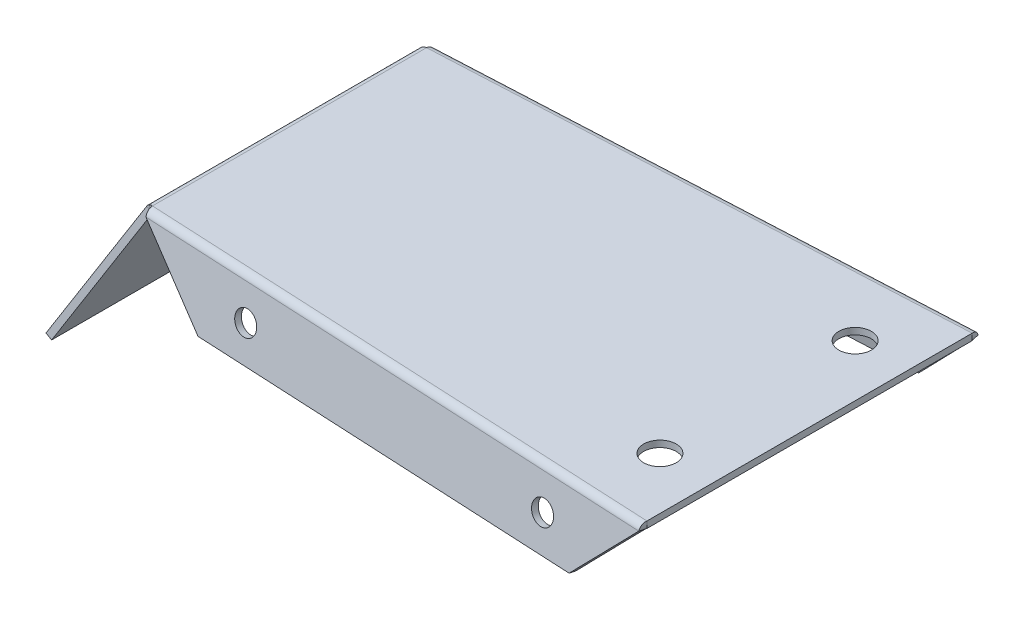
ISO-10303-21;
HEADER;
FILE_DESCRIPTION(('STEP AP214'),'2;1');
FILE_NAME('part.step','',(''),(''),'','','');
FILE_SCHEMA(('AUTOMOTIVE_DESIGN { 1 0 10303 214 1 1 1 1 }'));
ENDSEC;
DATA;
#1=APPLICATION_CONTEXT('core data for automotive mechanical design processes');
#2=APPLICATION_PROTOCOL_DEFINITION('international standard','automotive_design',2000,#1);
#3=PRODUCT_CONTEXT('',#1,'mechanical');
#4=PRODUCT('Part','Part','',(#3));
#5=PRODUCT_RELATED_PRODUCT_CATEGORY('part','',(#4));
#6=PRODUCT_DEFINITION_FORMATION('','',#4);
#7=PRODUCT_DEFINITION_CONTEXT('part definition',#1,'design');
#8=PRODUCT_DEFINITION('design','',#6,#7);
#9=PRODUCT_DEFINITION_SHAPE('','',#8);
#10=(LENGTH_UNIT() NAMED_UNIT(*) SI_UNIT(.MILLI.,.METRE.));
#11=(NAMED_UNIT(*) PLANE_ANGLE_UNIT() SI_UNIT($,.RADIAN.));
#12=(NAMED_UNIT(*) SI_UNIT($,.STERADIAN.) SOLID_ANGLE_UNIT());
#13=UNCERTAINTY_MEASURE_WITH_UNIT(LENGTH_MEASURE(1.E-05),#10,'distance_accuracy_value','');
#14=(GEOMETRIC_REPRESENTATION_CONTEXT(3) GLOBAL_UNCERTAINTY_ASSIGNED_CONTEXT((#13)) GLOBAL_UNIT_ASSIGNED_CONTEXT((#10,
#11,#12)) REPRESENTATION_CONTEXT('',''));
#15=CARTESIAN_POINT('',(0.,0.,0.));
#16=DIRECTION('',(0.,0.,1.));
#17=DIRECTION('',(1.,0.,0.));
#18=AXIS2_PLACEMENT_3D('',#15,#16,#17);
#19=CARTESIAN_POINT('',(105.,0.,-11.4));
#20=DIRECTION('',(0.,-1.,0.));
#21=DIRECTION('',(0.,0.,-1.));
#22=AXIS2_PLACEMENT_3D('',#19,#20,#21);
#23=PLANE('',#22);
#24=CARTESIAN_POINT('',(97.,0.,15.));
#25=DIRECTION('',(0.,1.,0.));
#26=DIRECTION('',(0.,0.,-1.));
#27=AXIS2_PLACEMENT_3D('',#24,#25,#26);
#28=CIRCLE('',#27,2.5);
#29=CARTESIAN_POINT('',(97.,0.,12.5));
#30=VERTEX_POINT('',#29);
#31=EDGE_CURVE('E714',#30,#30,#28,.T.);
#32=ORIENTED_EDGE('',*,*,#31,.F.);
#33=EDGE_LOOP('',(#32));
#34=FACE_BOUND('',#33,.T.);
#35=CARTESIAN_POINT('',(97.,0.,-15.));
#36=DIRECTION('',(0.,1.,0.));
#37=DIRECTION('',(0.,0.,1.));
#38=AXIS2_PLACEMENT_3D('',#35,#36,#37);
#39=CIRCLE('',#38,2.5);
#40=CARTESIAN_POINT('',(97.,0.,-12.5));
#41=VERTEX_POINT('',#40);
#42=EDGE_CURVE('E717',#41,#41,#39,.T.);
#43=ORIENTED_EDGE('',*,*,#42,.F.);
#44=EDGE_LOOP('',(#43));
#45=FACE_BOUND('',#44,.T.);
#46=DIRECTION('',(0.,0.,1.));
#47=VECTOR('',#46,1.);
#48=CARTESIAN_POINT('',(25.057735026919,0.,-11.4));
#49=LINE('',#48,#47);
#50=CARTESIAN_POINT('',(25.0577350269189,0.,-21.0606939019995));
#51=VERTEX_POINT('',#50);
#52=CARTESIAN_POINT('',(25.057735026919,0.,21.0606939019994));
#53=VERTEX_POINT('',#52);
#54=EDGE_CURVE('E709',#51,#53,#49,.T.);
#55=ORIENTED_EDGE('',*,*,#54,.T.);
#56=DIRECTION('',(0.998788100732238,0.,0.049217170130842));
#57=VECTOR('',#56,1.);
#58=CARTESIAN_POINT('',(103.210666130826,0.,24.911827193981));
#59=LINE('',#58,#57);
#60=CARTESIAN_POINT('',(105.,0.,25.));
#61=VERTEX_POINT('',#60);
#62=EDGE_CURVE('E104',#53,#61,#59,.T.);
#63=ORIENTED_EDGE('',*,*,#62,.T.);
#64=DIRECTION('',(0.,0.,-1.));
#65=VECTOR('',#64,1.);
#66=CARTESIAN_POINT('',(105.,0.,-25.));
#67=LINE('',#66,#65);
#68=CARTESIAN_POINT('',(105.,0.,-25.));
#69=VERTEX_POINT('',#68);
#70=EDGE_CURVE('E727',#61,#69,#67,.T.);
#71=ORIENTED_EDGE('',*,*,#70,.T.);
#72=DIRECTION('',(0.998788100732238,0.,-0.0492171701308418));
#73=VECTOR('',#72,1.);
#74=CARTESIAN_POINT('',(104.331457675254,0.,-24.9670563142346));
#75=LINE('',#74,#73);
#76=EDGE_CURVE('E120',#51,#69,#75,.T.);
#77=ORIENTED_EDGE('',*,*,#76,.F.);
#78=EDGE_LOOP('',(#55,#63,#71,#77));
#79=FACE_BOUND('',#78,.T.);
#80=ADVANCED_FACE('F94',(#34,#45,#79),#23,.F.);
#81=CARTESIAN_POINT('',(105.,-1.,-11.4));
#82=DIRECTION('',(0.,-1.,0.));
#83=DIRECTION('',(0.,0.,-1.));
#84=AXIS2_PLACEMENT_3D('',#81,#82,#83);
#85=PLANE('',#84);
#86=DIRECTION('',(0.998788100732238,0.,0.049217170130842));
#87=VECTOR('',#86,1.);
#88=CARTESIAN_POINT('',(103.210666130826,-1.,24.911827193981));
#89=LINE('',#88,#87);
#90=CARTESIAN_POINT('',(25.0577350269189,-1.,21.0606939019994));
#91=VERTEX_POINT('',#90);
#92=CARTESIAN_POINT('',(105.,-1.,25.));
#93=VERTEX_POINT('',#92);
#94=EDGE_CURVE('E1013',#91,#93,#89,.T.);
#95=ORIENTED_EDGE('',*,*,#94,.F.);
#96=DIRECTION('',(0.,0.,1.));
#97=VECTOR('',#96,1.);
#98=CARTESIAN_POINT('',(25.057735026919,-1.,-11.4));
#99=LINE('',#98,#97);
#100=CARTESIAN_POINT('',(25.057735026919,-1.,-21.0606939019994));
#101=VERTEX_POINT('',#100);
#102=EDGE_CURVE('E720',#101,#91,#99,.T.);
#103=ORIENTED_EDGE('',*,*,#102,.F.);
#104=DIRECTION('',(0.998788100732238,0.,-0.0492171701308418));
#105=VECTOR('',#104,1.);
#106=CARTESIAN_POINT('',(104.331457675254,-1.,-24.9670563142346));
#107=LINE('',#106,#105);
#108=CARTESIAN_POINT('',(105.,-1.,-25.));
#109=VERTEX_POINT('',#108);
#110=EDGE_CURVE('E793',#101,#109,#107,.T.);
#111=ORIENTED_EDGE('',*,*,#110,.T.);
#112=DIRECTION('',(0.,0.,-1.));
#113=VECTOR('',#112,1.);
#114=CARTESIAN_POINT('',(105.,-1.,-25.));
#115=LINE('',#114,#113);
#116=EDGE_CURVE('E713',#93,#109,#115,.T.);
#117=ORIENTED_EDGE('',*,*,#116,.F.);
#118=EDGE_LOOP('',(#95,#103,#111,#117));
#119=FACE_BOUND('',#118,.T.);
#120=CARTESIAN_POINT('',(97.,-1.,-15.));
#121=DIRECTION('',(0.,1.,0.));
#122=DIRECTION('',(0.,0.,1.));
#123=AXIS2_PLACEMENT_3D('',#120,#121,#122);
#124=CIRCLE('',#123,2.5);
#125=CARTESIAN_POINT('',(97.,-1.,-12.5));
#126=VERTEX_POINT('',#125);
#127=EDGE_CURVE('E701',#126,#126,#124,.T.);
#128=ORIENTED_EDGE('',*,*,#127,.T.);
#129=EDGE_LOOP('',(#128));
#130=FACE_BOUND('',#129,.T.);
#131=CARTESIAN_POINT('',(97.,-1.,15.));
#132=DIRECTION('',(0.,1.,0.));
#133=DIRECTION('',(0.,0.,-1.));
#134=AXIS2_PLACEMENT_3D('',#131,#132,#133);
#135=CIRCLE('',#134,2.5);
#136=CARTESIAN_POINT('',(97.,-1.,12.5));
#137=VERTEX_POINT('',#136);
#138=EDGE_CURVE('E710',#137,#137,#135,.T.);
#139=ORIENTED_EDGE('',*,*,#138,.T.);
#140=EDGE_LOOP('',(#139));
#141=FACE_BOUND('',#140,.T.);
#142=ADVANCED_FACE('F785',(#119,#130,#141),#85,.T.);
#143=CARTESIAN_POINT('',(12.4946300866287,-22.6599360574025,24.));
#144=DIRECTION('',(0.0595726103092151,0.103182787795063,0.992876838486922));
#145=DIRECTION('',(0.496438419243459,0.859856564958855,-0.119145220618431));
#146=AXIS2_PLACEMENT_3D('',#143,#144,#145);
#147=PLANE('',#146);
#148=DIRECTION('',(0.496438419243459,0.859856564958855,-0.119145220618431));
#149=VECTOR('',#148,1.);
#150=CARTESIAN_POINT('',(12.4946300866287,-22.6599360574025,24.));
#151=LINE('',#150,#149);
#152=CARTESIAN_POINT('',(12.4946300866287,-22.6599360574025,24.));
#153=VERTEX_POINT('',#152);
#154=CARTESIAN_POINT('',(24.9711324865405,-1.05,21.0056394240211));
#155=VERTEX_POINT('',#154);
#156=EDGE_CURVE('E733',#153,#155,#151,.T.);
#157=ORIENTED_EDGE('',*,*,#156,.T.);
#158=CARTESIAN_POINT('',(24.1051070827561,-0.550000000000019,21.0056394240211));
#159=CARTESIAN_POINT('',(24.9711324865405,-1.05,21.0056394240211));
#160=B_SPLINE_CURVE_WITH_KNOTS('',1,(#158,#159),.UNSPECIFIED.,.F.,.F.,(2,2),(0.,1.),.UNSPECIFIED.);
#161=CARTESIAN_POINT('',(24.1051070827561,-0.550000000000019,21.0056394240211));
#162=VERTEX_POINT('',#161);
#163=EDGE_CURVE('E674',#155,#162,#160,.F.);
#164=ORIENTED_EDGE('',*,*,#163,.T.);
#165=DIRECTION('',(0.496438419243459,0.859856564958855,-0.119145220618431));
#166=VECTOR('',#165,1.);
#167=CARTESIAN_POINT('',(11.6286046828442,-22.1599360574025,24.));
#168=LINE('',#167,#166);
#169=CARTESIAN_POINT('',(11.6286046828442,-22.1599360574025,24.));
#170=VERTEX_POINT('',#169);
#171=EDGE_CURVE('E738',#170,#162,#168,.T.);
#172=ORIENTED_EDGE('',*,*,#171,.F.);
#173=DIRECTION('',(-0.86602540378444,0.499999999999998,0.));
#174=VECTOR('',#173,1.);
#175=CARTESIAN_POINT('',(12.4946300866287,-22.6599360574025,24.));
#176=LINE('',#175,#174);
#177=EDGE_CURVE('E740',#153,#170,#176,.T.);
#178=ORIENTED_EDGE('',*,*,#177,.F.);
#179=EDGE_LOOP('',(#157,#164,#172,#178));
#180=FACE_BOUND('',#179,.T.);
#181=ADVANCED_FACE('F775',(#180),#147,.T.);
#182=CARTESIAN_POINT('',(12.4946300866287,-22.6599360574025,-24.));
#183=DIRECTION('',(0.0595726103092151,0.103182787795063,-0.992876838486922));
#184=DIRECTION('',(-0.496438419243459,-0.859856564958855,-0.119145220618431));
#185=AXIS2_PLACEMENT_3D('',#182,#183,#184);
#186=PLANE('',#185);
#187=DIRECTION('',(-0.496438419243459,-0.859856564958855,-0.119145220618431));
#188=VECTOR('',#187,1.);
#189=CARTESIAN_POINT('',(11.6286046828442,-22.1599360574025,-24.));
#190=LINE('',#189,#188);
#191=CARTESIAN_POINT('',(24.1051070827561,-0.550000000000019,-21.0056394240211));
#192=VERTEX_POINT('',#191);
#193=CARTESIAN_POINT('',(11.6286046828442,-22.1599360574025,-24.));
#194=VERTEX_POINT('',#193);
#195=EDGE_CURVE('E739',#192,#194,#190,.T.);
#196=ORIENTED_EDGE('',*,*,#195,.F.);
#197=CARTESIAN_POINT('',(24.9711324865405,-1.05,-21.0056394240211));
#198=CARTESIAN_POINT('',(24.1051070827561,-0.550000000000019,-21.0056394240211));
#199=B_SPLINE_CURVE_WITH_KNOTS('',1,(#197,#198),.UNSPECIFIED.,.F.,.F.,(2,2),(0.,1.),.UNSPECIFIED.);
#200=CARTESIAN_POINT('',(24.9711324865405,-1.05,-21.0056394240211));
#201=VERTEX_POINT('',#200);
#202=EDGE_CURVE('E662',#192,#201,#199,.F.);
#203=ORIENTED_EDGE('',*,*,#202,.T.);
#204=DIRECTION('',(-0.496438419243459,-0.859856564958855,-0.119145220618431));
#205=VECTOR('',#204,1.);
#206=CARTESIAN_POINT('',(12.4946300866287,-22.6599360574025,-24.));
#207=LINE('',#206,#205);
#208=CARTESIAN_POINT('',(12.4946300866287,-22.6599360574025,-24.));
#209=VERTEX_POINT('',#208);
#210=EDGE_CURVE('E734',#201,#209,#207,.T.);
#211=ORIENTED_EDGE('',*,*,#210,.T.);
#212=DIRECTION('',(-0.86602540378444,0.499999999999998,0.));
#213=VECTOR('',#212,1.);
#214=CARTESIAN_POINT('',(12.4946300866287,-22.6599360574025,-24.));
#215=LINE('',#214,#213);
#216=EDGE_CURVE('E743',#209,#194,#215,.T.);
#217=ORIENTED_EDGE('',*,*,#216,.T.);
#218=EDGE_LOOP('',(#196,#203,#211,#217));
#219=FACE_BOUND('',#218,.T.);
#220=ADVANCED_FACE('F764',(#219),#186,.T.);
#221=CARTESIAN_POINT('',(64.9946300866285,68.2727313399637,-11.4));
#222=DIRECTION('',(0.86602540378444,-0.499999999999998,0.));
#223=DIRECTION('',(0.,0.,-1.));
#224=AXIS2_PLACEMENT_3D('',#221,#222,#223);
#225=PLANE('',#224);
#226=ORIENTED_EDGE('',*,*,#210,.F.);
#227=DIRECTION('',(0.,0.,1.));
#228=VECTOR('',#227,1.);
#229=CARTESIAN_POINT('',(24.9711324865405,-1.05,-11.4));
#230=LINE('',#229,#228);
#231=EDGE_CURVE('E742',#201,#155,#230,.T.);
#232=ORIENTED_EDGE('',*,*,#231,.T.);
#233=ORIENTED_EDGE('',*,*,#156,.F.);
#234=DIRECTION('',(0.,0.,1.));
#235=VECTOR('',#234,1.);
#236=CARTESIAN_POINT('',(12.4946300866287,-22.6599360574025,24.));
#237=LINE('',#236,#235);
#238=EDGE_CURVE('E730',#209,#153,#237,.T.);
#239=ORIENTED_EDGE('',*,*,#238,.F.);
#240=EDGE_LOOP('',(#226,#232,#233,#239));
#241=FACE_BOUND('',#240,.T.);
#242=ADVANCED_FACE('F774',(#241),#225,.T.);
#243=CARTESIAN_POINT('',(12.4946300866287,-22.6599360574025,24.));
#244=DIRECTION('',(-0.499999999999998,-0.86602540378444,0.));
#245=DIRECTION('',(0.,0.,1.));
#246=AXIS2_PLACEMENT_3D('',#243,#244,#245);
#247=PLANE('',#246);
#248=DIRECTION('',(0.,0.,1.));
#249=VECTOR('',#248,1.);
#250=CARTESIAN_POINT('',(11.6286046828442,-22.1599360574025,24.));
#251=LINE('',#250,#249);
#252=EDGE_CURVE('E735',#194,#170,#251,.T.);
#253=ORIENTED_EDGE('',*,*,#252,.F.);
#254=ORIENTED_EDGE('',*,*,#216,.F.);
#255=ORIENTED_EDGE('',*,*,#238,.T.);
#256=ORIENTED_EDGE('',*,*,#177,.T.);
#257=EDGE_LOOP('',(#253,#254,#255,#256));
#258=FACE_BOUND('',#257,.T.);
#259=ADVANCED_FACE('F781',(#258),#247,.T.);
#260=CARTESIAN_POINT('',(64.128604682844,68.7727313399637,-11.4));
#261=DIRECTION('',(0.86602540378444,-0.499999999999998,0.));
#262=DIRECTION('',(0.,0.,-1.));
#263=AXIS2_PLACEMENT_3D('',#260,#261,#262);
#264=PLANE('',#263);
#265=DIRECTION('',(0.,0.,1.));
#266=VECTOR('',#265,1.);
#267=CARTESIAN_POINT('',(24.1051070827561,-0.550000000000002,-11.4));
#268=LINE('',#267,#266);
#269=EDGE_CURVE('E908',#192,#162,#268,.T.);
#270=ORIENTED_EDGE('',*,*,#269,.F.);
#271=ORIENTED_EDGE('',*,*,#195,.T.);
#272=ORIENTED_EDGE('',*,*,#252,.T.);
#273=ORIENTED_EDGE('',*,*,#171,.T.);
#274=EDGE_LOOP('',(#270,#271,#272,#273));
#275=FACE_BOUND('',#274,.T.);
#276=ADVANCED_FACE('F777',(#275),#264,.F.);
#277=CARTESIAN_POINT('',(97.,-1.,-15.));
#278=DIRECTION('',(0.,1.,0.));
#279=DIRECTION('',(0.,0.,1.));
#280=AXIS2_PLACEMENT_3D('',#277,#278,#279);
#281=CYLINDRICAL_SURFACE('',#280,2.5);
#282=ORIENTED_EDGE('',*,*,#127,.F.);
#283=EDGE_LOOP('',(#282));
#284=FACE_BOUND('',#283,.T.);
#285=ORIENTED_EDGE('',*,*,#42,.T.);
#286=EDGE_LOOP('',(#285));
#287=FACE_BOUND('',#286,.T.);
#288=ADVANCED_FACE('F780',(#284,#287),#281,.F.);
#289=CARTESIAN_POINT('',(97.,-1.,15.));
#290=DIRECTION('',(0.,1.,0.));
#291=DIRECTION('',(0.,0.,1.));
#292=AXIS2_PLACEMENT_3D('',#289,#290,#291);
#293=CYLINDRICAL_SURFACE('',#292,2.5);
#294=ORIENTED_EDGE('',*,*,#138,.F.);
#295=EDGE_LOOP('',(#294));
#296=FACE_BOUND('',#295,.T.);
#297=ORIENTED_EDGE('',*,*,#31,.T.);
#298=EDGE_LOOP('',(#297));
#299=FACE_BOUND('',#298,.T.);
#300=ADVANCED_FACE('F937',(#296,#299),#293,.F.);
#301=CARTESIAN_POINT('',(105.,-1.,-25.));
#302=DIRECTION('',(1.,0.,0.));
#303=DIRECTION('',(0.,0.,-1.));
#304=AXIS2_PLACEMENT_3D('',#301,#302,#303);
#305=PLANE('',#304);
#306=ORIENTED_EDGE('',*,*,#70,.F.);
#307=CARTESIAN_POINT('',(105.,-1.,25.));
#308=CARTESIAN_POINT('',(105.,0.,25.));
#309=B_SPLINE_CURVE_WITH_KNOTS('',1,(#307,#308),.UNSPECIFIED.,.F.,.F.,(2,2),(0.,1.),.UNSPECIFIED.);
#310=EDGE_CURVE('E357',#93,#61,#309,.T.);
#311=ORIENTED_EDGE('',*,*,#310,.F.);
#312=ORIENTED_EDGE('',*,*,#116,.T.);
#313=CARTESIAN_POINT('',(105.,0.,-25.0000000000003));
#314=CARTESIAN_POINT('',(105.,-1.,-25.));
#315=B_SPLINE_CURVE_WITH_KNOTS('',1,(#313,#314),.UNSPECIFIED.,.F.,.F.,(2,2),(0.,1.),.UNSPECIFIED.);
#316=EDGE_CURVE('E521',#109,#69,#315,.F.);
#317=ORIENTED_EDGE('',*,*,#316,.T.);
#318=EDGE_LOOP('',(#306,#311,#312,#317));
#319=FACE_BOUND('',#318,.T.);
#320=ADVANCED_FACE('F620',(#319),#305,.T.);
#321=CARTESIAN_POINT('',(24.1051070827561,-0.550000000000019,-21.0056394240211));
#322=CARTESIAN_POINT('',(24.1913523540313,-0.400618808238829,-21.0037499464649));
#323=CARTESIAN_POINT('',(24.3128647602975,-0.27240029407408,-21.0018743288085));
#324=CARTESIAN_POINT('',(24.457402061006,-0.178262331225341,-21.));
#325=CARTESIAN_POINT('',(24.9711324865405,-1.05,-21.0056394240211));
#326=CARTESIAN_POINT('',(24.9789728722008,-1.03642005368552,-21.0037499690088));
#327=CARTESIAN_POINT('',(24.9900197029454,-1.02476356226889,-21.0018743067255));
#328=CARTESIAN_POINT('',(25.0031593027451,-1.01620566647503,-21.));
#329=B_SPLINE_SURFACE_WITH_KNOTS('',1,3,((#321,#322,#323,#324),(#325,#326,#327,#328)),
.UNSPECIFIED.,.F.,.F.,.F.,(2,2),(4,4),(0.,1.),(0.,1.),.UNSPECIFIED.);
#330=CARTESIAN_POINT('',(24.1051070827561,-0.550000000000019,-21.0056394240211));
#331=CARTESIAN_POINT('',(24.1913523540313,-0.400618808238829,-21.0037499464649));
#332=CARTESIAN_POINT('',(24.3128647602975,-0.27240029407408,-21.0018743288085));
#333=CARTESIAN_POINT('',(24.457402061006,-0.178262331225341,-21.));
#334=B_SPLINE_CURVE_WITH_KNOTS('',3,(#330,#331,#332,#333),.UNSPECIFIED.,.F.,.F.,(4,4),(0.,1.),.UNSPECIFIED.);
#335=CARTESIAN_POINT('',(24.4573981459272,-0.178264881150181,-21.00000005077));
#336=VERTEX_POINT('',#335);
#337=EDGE_CURVE('E817',#192,#336,#334,.T.);
#338=CARTESIAN_POINT('',(24.457402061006,-0.178262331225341,-21.));
#339=CARTESIAN_POINT('',(25.0031593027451,-1.01620566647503,-21.));
#340=B_SPLINE_CURVE_WITH_KNOTS('',1,(#338,#339),.UNSPECIFIED.,.F.,.F.,(2,2),(0.,1.),.UNSPECIFIED.);
#341=CARTESIAN_POINT('',(25.0031593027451,-1.01620566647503,-21.));
#342=VERTEX_POINT('',#341);
#343=EDGE_CURVE('E651',#336,#342,#340,.T.);
#344=CARTESIAN_POINT('',(25.0031593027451,-1.01620566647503,-21.));
#345=CARTESIAN_POINT('',(24.9900197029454,-1.02476356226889,-21.0018743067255));
#346=CARTESIAN_POINT('',(24.9789728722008,-1.03642005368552,-21.0037499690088));
#347=CARTESIAN_POINT('',(24.9711324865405,-1.05,-21.0056394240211));
#348=B_SPLINE_CURVE_WITH_KNOTS('',3,(#344,#345,#346,#347),.UNSPECIFIED.,.F.,.F.,(4,4),(0.,1.),.UNSPECIFIED.);
#349=EDGE_CURVE('E603',#201,#342,#348,.F.);
#350=ORIENTED_EDGE('',*,*,#202,.F.);
#351=ORIENTED_EDGE('',*,*,#337,.T.);
#352=ORIENTED_EDGE('',*,*,#343,.T.);
#353=ORIENTED_EDGE('',*,*,#349,.F.);
#354=EDGE_LOOP('',(#350,#351,#352,#353));
#355=FACE_BOUND('',#354,.T.);
#356=ADVANCED_FACE('F608',(#355),#329,.F.);
#357=CARTESIAN_POINT('',(24.4465629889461,-0.173387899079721,-20.9993880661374));
#358=CARTESIAN_POINT('',(24.4483568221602,-0.172219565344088,-20.9995920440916));
#359=CARTESIAN_POINT('',(24.4501506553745,-0.171051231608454,-20.9997960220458));
#360=CARTESIAN_POINT('',(24.4519444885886,-0.169882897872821,-21.));
#361=CARTESIAN_POINT('',(24.6313278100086,-0.0530495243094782,-21.0203977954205));
#362=CARTESIAN_POINT('',(24.8436592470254,0.01,-21.0405382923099));
#363=CARTESIAN_POINT('',(25.057735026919,0.01,-21.0606939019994));
#364=CARTESIAN_POINT('',(24.4520690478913,-0.181735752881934,-20.9993880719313));
#365=CARTESIAN_POINT('',(24.4538467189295,-0.180577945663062,-20.9995920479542));
#366=CARTESIAN_POINT('',(24.4556243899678,-0.17942013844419,-20.9997960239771));
#367=CARTESIAN_POINT('',(24.457402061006,-0.178262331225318,-21.));
#368=CARTESIAN_POINT('',(24.6351691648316,-0.0624816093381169,-21.0203976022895));
#369=CARTESIAN_POINT('',(24.8455880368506,0.,-21.0405384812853));
#370=CARTESIAN_POINT('',(25.057735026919,0.,-21.0606939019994));
#371=CARTESIAN_POINT('',(25.0026749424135,-1.01652113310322,-20.9993886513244));
#372=CARTESIAN_POINT('',(25.0028363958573,-1.01641597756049,-20.9995924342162));
#373=CARTESIAN_POINT('',(25.0029978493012,-1.01631082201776,-20.9997962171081));
#374=CARTESIAN_POINT('',(25.0031593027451,-1.01620566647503,-21.));
#375=CARTESIAN_POINT('',(25.019304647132,-1.00569011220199,-21.0203782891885));
#376=CARTESIAN_POINT('',(25.0384670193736,-1.,-21.0405573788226));
#377=CARTESIAN_POINT('',(25.057735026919,-1.,-21.0606939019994));
#378=B_SPLINE_SURFACE_WITH_KNOTS('',1,3,((#357,#358,#359,#360,#361,#362,#363),(#364,#365,#366,
#367,#368,#369,#370),(#371,#372,#373,#374,#375,#376,#377)),.UNSPECIFIED.,.F.,.F.,.F.,(2,1,2),(4,
3,4),(-0.01,0.,1.),(-0.01,0.,1.),.UNSPECIFIED.);
#379=CARTESIAN_POINT('',(24.4573981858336,-0.178264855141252,-20.9999995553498));
#380=CARTESIAN_POINT('',(24.480476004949,-0.163234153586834,-21.0026477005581));
#381=CARTESIAN_POINT('',(24.5041093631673,-0.149076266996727,-21.0052930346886));
#382=CARTESIAN_POINT('',(24.5523622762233,-0.122576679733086,-21.0105786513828));
#383=CARTESIAN_POINT('',(24.5769814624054,-0.110234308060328,-21.0132189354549));
#384=CARTESIAN_POINT('',(24.652131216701,-0.0760321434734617,-21.0211333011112));
#385=CARTESIAN_POINT('',(24.7039778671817,-0.0569817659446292,-21.0264036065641));
#386=CARTESIAN_POINT('',(24.8057346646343,-0.0280533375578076,-21.0365107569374));
#387=CARTESIAN_POINT('',(24.8554757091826,-0.0175710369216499,-21.0413490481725));
#388=CARTESIAN_POINT('',(24.9560479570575,-0.00352633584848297,-21.0510244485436));
#389=CARTESIAN_POINT('',(25.006881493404,1.93706793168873E-05,-21.0558615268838));
#390=CARTESIAN_POINT('',(25.0577350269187,0.,-21.0606939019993));
#391=B_SPLINE_CURVE_WITH_KNOTS('',3,(#379,#380,#381,#382,#383,#384,#385,#386,#387,#388,#389,
#390),.UNSPECIFIED.,.F.,.F.,(4,2,2,2,2,4),(0.,0.0829627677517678,0.16589479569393,
0.331673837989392,0.48439586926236,0.637484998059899),.UNSPECIFIED.);
#392=EDGE_CURVE('E815',#336,#51,#391,.T.);
#393=CARTESIAN_POINT('',(25.057735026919,0.01,-21.0606939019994));
#394=CARTESIAN_POINT('',(25.057735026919,0.,-21.0606939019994));
#395=CARTESIAN_POINT('',(25.057735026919,-1.,-21.0606939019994));
#396=B_SPLINE_CURVE_WITH_KNOTS('',1,(#393,#394,#395),.UNSPECIFIED.,.F.,.F.,(2,1,2),(-0.01,0.,
1.),.UNSPECIFIED.);
#397=EDGE_CURVE('E508',#51,#101,#396,.T.);
#398=CARTESIAN_POINT('',(25.0031593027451,-1.01620566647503,-21.));
#399=CARTESIAN_POINT('',(25.0079642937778,-1.01306666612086,-21.0060711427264));
#400=CARTESIAN_POINT('',(25.0130495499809,-1.01035164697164,-21.0121352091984));
#401=CARTESIAN_POINT('',(25.0236203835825,-1.00582631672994,-21.0242524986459));
#402=CARTESIAN_POINT('',(25.029105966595,-1.00401601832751,-21.030305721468));
#403=CARTESIAN_POINT('',(25.0422345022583,-1.00090219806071,-21.0444736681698));
#404=CARTESIAN_POINT('',(25.0499735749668,-0.999983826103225,-21.0525853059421));
#405=CARTESIAN_POINT('',(25.057735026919,-1.,-21.0606939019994));
#406=B_SPLINE_CURVE_WITH_KNOTS('',3,(#398,#399,#400,#401,#402,#403,#404,#405),.UNSPECIFIED.,.F.,
.F.,(4,2,2,4),(0.,0.0250438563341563,0.0500880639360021,0.083698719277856),.UNSPECIFIED.);
#407=EDGE_CURVE('E806',#342,#101,#406,.T.);
#408=ORIENTED_EDGE('',*,*,#343,.F.);
#409=ORIENTED_EDGE('',*,*,#392,.T.);
#410=ORIENTED_EDGE('',*,*,#397,.T.);
#411=ORIENTED_EDGE('',*,*,#407,.F.);
#412=EDGE_LOOP('',(#408,#409,#410,#411));
#413=FACE_BOUND('',#412,.T.);
#414=ADVANCED_FACE('F619',(#413),#378,.F.);
#415=CARTESIAN_POINT('',(25.057735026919,0.01,21.0606939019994));
#416=CARTESIAN_POINT('',(24.8436593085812,0.01,21.0402961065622));
#417=CARTESIAN_POINT('',(24.6313278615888,-0.0530494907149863,21.0201556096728));
#418=CARTESIAN_POINT('',(24.4519444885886,-0.169882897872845,21.));
#419=CARTESIAN_POINT('',(25.057735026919,0.,21.0606939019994));
#420=CARTESIAN_POINT('',(24.845588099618,0.,21.0402962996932));
#421=CARTESIAN_POINT('',(24.6351692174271,-0.0624815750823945,21.0201554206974));
#422=CARTESIAN_POINT('',(24.457402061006,-0.178262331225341,21.));
#423=CARTESIAN_POINT('',(25.057735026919,-1.,21.0606939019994));
#424=CARTESIAN_POINT('',(25.0384672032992,-1.,21.0403156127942));
#425=CARTESIAN_POINT('',(25.0193048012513,-1.00569001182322,21.0201365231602));
#426=CARTESIAN_POINT('',(25.0031593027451,-1.01620566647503,21.));
#427=B_SPLINE_SURFACE_WITH_KNOTS('',1,3,((#415,#416,#417,#418),(#419,#420,#421,#422),(#423,#424,
#425,#426)),.UNSPECIFIED.,.F.,.F.,.F.,(2,1,2),(4,4),(-0.01,0.,1.),(0.,1.),.UNSPECIFIED.);
#428=CARTESIAN_POINT('',(25.057735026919,-1.,21.0606939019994));
#429=CARTESIAN_POINT('',(25.057735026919,0.,21.0606939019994));
#430=CARTESIAN_POINT('',(25.057735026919,0.01,21.0606939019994));
#431=B_SPLINE_CURVE_WITH_KNOTS('',1,(#428,#429,#430),.UNSPECIFIED.,.F.,.F.,(2,1,2),(-0.01,0.99,
1.),.UNSPECIFIED.);
#432=EDGE_CURVE('E12',#91,#53,#431,.T.);
#433=CARTESIAN_POINT('',(25.057735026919,0.,21.0606939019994));
#434=CARTESIAN_POINT('',(25.0301940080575,-1.26566470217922E-07,21.0580457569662));
#435=CARTESIAN_POINT('',(25.0026638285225,-0.00103481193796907,21.055400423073));
#436=CARTESIAN_POINT('',(24.9477682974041,-0.00516426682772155,21.0501148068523));
#437=CARTESIAN_POINT('',(24.9204028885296,-0.00825827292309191,21.0474745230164));
#438=CARTESIAN_POINT('',(24.8387656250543,-0.0206126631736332,21.0395601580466));
#439=CARTESIAN_POINT('',(24.7849242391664,-0.0329454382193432,21.0342898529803));
#440=CARTESIAN_POINT('',(24.6838715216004,-0.0642395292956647,21.0241828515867));
#441=CARTESIAN_POINT('',(24.6364720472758,-0.0826020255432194,21.0193447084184));
#442=CARTESIAN_POINT('',(24.5445360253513,-0.125720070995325,21.0096696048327));
#443=CARTESIAN_POINT('',(24.5000066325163,-0.150490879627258,21.0048326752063));
#444=CARTESIAN_POINT('',(24.457406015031,-0.178259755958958,21.0000004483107));
#445=B_SPLINE_CURVE_WITH_KNOTS('',3,(#433,#434,#435,#436,#437,#438,#439,#440,#441,#442,#443,
#444),.UNSPECIFIED.,.F.,.F.,(4,2,2,2,2,4),(0.,0.0829627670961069,0.165894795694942,
0.331673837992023,0.484391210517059,0.63747563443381),.UNSPECIFIED.);
#446=CARTESIAN_POINT('',(24.4574060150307,-0.178259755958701,21.0000004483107));
#447=VERTEX_POINT('',#446);
#448=EDGE_CURVE('E816',#53,#447,#445,.T.);
#449=CARTESIAN_POINT('',(24.4519444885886,-0.169882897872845,21.));
#450=CARTESIAN_POINT('',(24.457402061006,-0.178262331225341,21.));
#451=CARTESIAN_POINT('',(25.0031593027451,-1.01620566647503,21.));
#452=B_SPLINE_CURVE_WITH_KNOTS('',1,(#449,#450,#451),.UNSPECIFIED.,.F.,.F.,(2,1,2),(-0.01,0.,
1.),.UNSPECIFIED.);
#453=CARTESIAN_POINT('',(25.0031593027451,-1.01620566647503,21.));
#454=VERTEX_POINT('',#453);
#455=EDGE_CURVE('E688',#447,#454,#452,.T.);
#456=CARTESIAN_POINT('',(25.057735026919,-1.,21.0606939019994));
#457=CARTESIAN_POINT('',(25.0519955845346,-0.999992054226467,21.0546227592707));
#458=CARTESIAN_POINT('',(25.0462526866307,-1.00049233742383,21.048558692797));
#459=CARTESIAN_POINT('',(25.0349251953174,-1.00246947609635,21.0364414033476));
#460=CARTESIAN_POINT('',(25.0293406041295,-1.00394634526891,21.0303881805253));
#461=CARTESIAN_POINT('',(25.0166402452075,-1.00850213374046,21.0162202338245));
#462=CARTESIAN_POINT('',(25.0096541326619,-1.01195624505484,21.0081085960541));
#463=CARTESIAN_POINT('',(25.0031593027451,-1.01620566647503,21.));
#464=B_SPLINE_CURVE_WITH_KNOTS('',3,(#456,#457,#458,#459,#460,#461,#462,#463),.UNSPECIFIED.,.F.,
.F.,(4,2,2,4),(0.,0.0250438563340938,0.0500880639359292,0.0836987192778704),.UNSPECIFIED.);
#465=EDGE_CURVE('E810',#91,#454,#464,.T.);
#466=ORIENTED_EDGE('',*,*,#432,.T.);
#467=ORIENTED_EDGE('',*,*,#448,.T.);
#468=ORIENTED_EDGE('',*,*,#455,.T.);
#469=ORIENTED_EDGE('',*,*,#465,.F.);
#470=EDGE_LOOP('',(#466,#467,#468,#469));
#471=FACE_BOUND('',#470,.T.);
#472=ADVANCED_FACE('F572',(#471),#427,.F.);
#473=CARTESIAN_POINT('',(24.457402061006,-0.178262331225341,21.));
#474=CARTESIAN_POINT('',(24.3128647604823,-0.272400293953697,21.0018894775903));
#475=CARTESIAN_POINT('',(24.1913523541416,-0.400618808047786,21.0037650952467));
#476=CARTESIAN_POINT('',(24.1051070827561,-0.550000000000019,21.0056394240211));
#477=CARTESIAN_POINT('',(25.0031593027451,-1.01620566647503,21.));
#478=CARTESIAN_POINT('',(24.9900197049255,-1.02476356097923,21.0018894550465));
#479=CARTESIAN_POINT('',(24.9789728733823,-1.03642005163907,21.0037651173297));
#480=CARTESIAN_POINT('',(24.9711324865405,-1.05,21.0056394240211));
#481=B_SPLINE_SURFACE_WITH_KNOTS('',1,3,((#473,#474,#475,#476),(#477,#478,#479,#480)),
.UNSPECIFIED.,.F.,.F.,.F.,(2,2),(4,4),(0.,1.),(0.,1.),.UNSPECIFIED.);
#482=CARTESIAN_POINT('',(24.457402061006,-0.178262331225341,21.));
#483=CARTESIAN_POINT('',(24.3128647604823,-0.272400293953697,21.0018894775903));
#484=CARTESIAN_POINT('',(24.1913523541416,-0.400618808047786,21.0037650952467));
#485=CARTESIAN_POINT('',(24.1051070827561,-0.550000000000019,21.0056394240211));
#486=B_SPLINE_CURVE_WITH_KNOTS('',3,(#482,#483,#484,#485),.UNSPECIFIED.,.F.,.F.,(4,4),(0.,1.),.UNSPECIFIED.);
#487=EDGE_CURVE('E558',#447,#162,#486,.T.);
#488=CARTESIAN_POINT('',(24.9711324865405,-1.05,21.0056394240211));
#489=CARTESIAN_POINT('',(24.9789728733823,-1.03642005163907,21.0037651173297));
#490=CARTESIAN_POINT('',(24.9900197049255,-1.02476356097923,21.0018894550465));
#491=CARTESIAN_POINT('',(25.0031593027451,-1.01620566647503,21.));
#492=B_SPLINE_CURVE_WITH_KNOTS('',3,(#488,#489,#490,#491),.UNSPECIFIED.,.F.,.F.,(4,4),(0.,1.),.UNSPECIFIED.);
#493=EDGE_CURVE('E547',#454,#155,#492,.F.);
#494=ORIENTED_EDGE('',*,*,#487,.T.);
#495=ORIENTED_EDGE('',*,*,#163,.F.);
#496=ORIENTED_EDGE('',*,*,#493,.F.);
#497=ORIENTED_EDGE('',*,*,#455,.F.);
#498=EDGE_LOOP('',(#494,#495,#496,#497));
#499=FACE_BOUND('',#498,.T.);
#500=ADVANCED_FACE('F571',(#499),#481,.F.);
#501=CARTESIAN_POINT('',(25.057735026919,-1.1,42.1333867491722));
#502=DIRECTION('',(0.,0.,-1.));
#503=DIRECTION('',(-1.,0.,0.));
#504=AXIS2_PLACEMENT_3D('',#501,#502,#503);
#505=CYLINDRICAL_SURFACE('',#504,0.1);
#506=ORIENTED_EDGE('',*,*,#465,.T.);
#507=ORIENTED_EDGE('',*,*,#493,.T.);
#508=ORIENTED_EDGE('',*,*,#231,.F.);
#509=ORIENTED_EDGE('',*,*,#349,.T.);
#510=ORIENTED_EDGE('',*,*,#407,.T.);
#511=ORIENTED_EDGE('',*,*,#102,.T.);
#512=EDGE_LOOP('',(#506,#507,#508,#509,#510,#511));
#513=FACE_BOUND('',#512,.T.);
#514=ADVANCED_FACE('F481',(#513),#505,.F.);
#515=CARTESIAN_POINT('',(25.057735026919,-1.1,42.1333867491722));
#516=DIRECTION('',(0.,0.,-1.));
#517=DIRECTION('',(-1.,0.,0.));
#518=AXIS2_PLACEMENT_3D('',#515,#516,#517);
#519=CYLINDRICAL_SURFACE('',#518,1.1);
#520=ORIENTED_EDGE('',*,*,#448,.F.);
#521=ORIENTED_EDGE('',*,*,#54,.F.);
#522=ORIENTED_EDGE('',*,*,#392,.F.);
#523=ORIENTED_EDGE('',*,*,#337,.F.);
#524=ORIENTED_EDGE('',*,*,#269,.T.);
#525=ORIENTED_EDGE('',*,*,#487,.F.);
#526=EDGE_LOOP('',(#520,#521,#522,#523,#524,#525));
#527=FACE_BOUND('',#526,.T.);
#528=ADVANCED_FACE('F477',(#527),#519,.T.);
#529=CARTESIAN_POINT('',(25.0577350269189,0.,-21.0606939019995));
#530=CARTESIAN_POINT('',(25.0636369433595,0.,-21.1891451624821));
#531=CARTESIAN_POINT('',(25.0695390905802,-0.0225626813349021,-21.3175362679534));
#532=CARTESIAN_POINT('',(25.0821013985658,-0.110113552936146,-21.5589912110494));
#533=CARTESIAN_POINT('',(25.0887638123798,-0.175080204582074,-21.6719815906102));
#534=CARTESIAN_POINT('',(25.1035138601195,-0.339622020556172,-21.8690396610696));
#535=CARTESIAN_POINT('',(25.1116038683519,-0.439156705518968,-21.953059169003));
#536=CARTESIAN_POINT('',(25.1297057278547,-0.660843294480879,-22.0820972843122));
#537=CARTESIAN_POINT('',(25.1397178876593,-0.782926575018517,-22.1270818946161));
#538=CARTESIAN_POINT('',(25.1508258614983,-0.908987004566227,-22.149884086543));
#539=CARTESIAN_POINT('',(25.057735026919,-1.,-21.0606939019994));
#540=CARTESIAN_POINT('',(25.0693635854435,-1.,-21.0729171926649));
#541=CARTESIAN_POINT('',(25.0809910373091,-1.00205115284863,-21.0851363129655));
#542=CARTESIAN_POINT('',(25.1043159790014,-1.0100103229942,-21.1081798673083));
#543=CARTESIAN_POINT('',(25.1160131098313,-1.01591638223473,-21.1189982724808));
#544=CARTESIAN_POINT('',(25.1395369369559,-1.03087472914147,-21.138005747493));
#545=CARTESIAN_POINT('',(25.1513638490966,-1.03992333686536,-21.146190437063));
#546=CARTESIAN_POINT('',(25.1751923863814,-1.06007666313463,-21.1590142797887));
#547=CARTESIAN_POINT('',(25.187193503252,-1.07117580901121,-21.1636504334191));
#548=CARTESIAN_POINT('',(25.1992953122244,-1.08263518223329,-21.1662698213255));
#549=B_SPLINE_SURFACE_WITH_KNOTS('',1,3,((#529,#530,#531,#532,#533,#534,#535,#536,#537,#538),
(#539,#540,#541,#542,#543,#544,#545,#546,#547,#548)),.UNSPECIFIED.,.F.,.F.,.F.,(2,2),(4,2,2,2,
4),(0.,1.),(0.,0.25,0.5,0.75,1.),.UNSPECIFIED.);
#550=CARTESIAN_POINT('',(25.0577350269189,0.,-21.0606939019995));
#551=CARTESIAN_POINT('',(25.0636369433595,0.,-21.1891451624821));
#552=CARTESIAN_POINT('',(25.0695390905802,-0.0225626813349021,-21.3175362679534));
#553=CARTESIAN_POINT('',(25.0821013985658,-0.110113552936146,-21.5589912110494));
#554=CARTESIAN_POINT('',(25.0887638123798,-0.175080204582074,-21.6719815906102));
#555=CARTESIAN_POINT('',(25.1035138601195,-0.339622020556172,-21.8690396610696));
#556=CARTESIAN_POINT('',(25.1116038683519,-0.439156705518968,-21.953059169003));
#557=CARTESIAN_POINT('',(25.1297057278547,-0.660843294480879,-22.0820972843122));
#558=CARTESIAN_POINT('',(25.1397178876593,-0.782926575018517,-22.1270818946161));
#559=CARTESIAN_POINT('',(25.1508258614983,-0.908987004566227,-22.149884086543));
#560=B_SPLINE_CURVE_WITH_KNOTS('',3,(#550,#551,#552,#553,#554,#555,#556,#557,#558,#559),
.UNSPECIFIED.,.F.,.F.,(4,2,2,2,4),(0.,0.25,0.5,0.75,1.),.UNSPECIFIED.);
#561=CARTESIAN_POINT('',(25.1508258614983,-0.908987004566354,-22.149884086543));
#562=VERTEX_POINT('',#561);
#563=EDGE_CURVE('E369',#51,#562,#560,.T.);
#564=CARTESIAN_POINT('',(25.1508258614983,-0.908987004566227,-22.149884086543));
#565=CARTESIAN_POINT('',(25.1992953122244,-1.08263518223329,-21.1662698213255));
#566=B_SPLINE_CURVE_WITH_KNOTS('',1,(#564,#565),.UNSPECIFIED.,.F.,.F.,(2,2),(0.,1.),.UNSPECIFIED.);
#567=CARTESIAN_POINT('',(25.1992953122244,-1.08263518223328,-21.1662698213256));
#568=VERTEX_POINT('',#567);
#569=EDGE_CURVE('E402',#562,#568,#566,.T.);
#570=CARTESIAN_POINT('',(25.1992953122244,-1.08263518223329,-21.1662698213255));
#571=CARTESIAN_POINT('',(25.187193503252,-1.07117580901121,-21.1636504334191));
#572=CARTESIAN_POINT('',(25.1751923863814,-1.06007666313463,-21.1590142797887));
#573=CARTESIAN_POINT('',(25.1513638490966,-1.03992333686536,-21.146190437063));
#574=CARTESIAN_POINT('',(25.1395369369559,-1.03087472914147,-21.138005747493));
#575=CARTESIAN_POINT('',(25.1160131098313,-1.01591638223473,-21.1189982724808));
#576=CARTESIAN_POINT('',(25.1043159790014,-1.0100103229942,-21.1081798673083));
#577=CARTESIAN_POINT('',(25.0809910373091,-1.00205115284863,-21.0851363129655));
#578=CARTESIAN_POINT('',(25.0693635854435,-1.,-21.0729171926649));
#579=CARTESIAN_POINT('',(25.057735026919,-1.,-21.0606939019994));
#580=B_SPLINE_CURVE_WITH_KNOTS('',3,(#570,#571,#572,#573,#574,#575,#576,#577,#578,#579),
.UNSPECIFIED.,.F.,.F.,(4,2,2,2,4),(0.,0.25,0.5,0.75,1.),.UNSPECIFIED.);
#581=EDGE_CURVE('E445',#101,#568,#580,.F.);
#582=ORIENTED_EDGE('',*,*,#397,.F.);
#583=ORIENTED_EDGE('',*,*,#563,.T.);
#584=ORIENTED_EDGE('',*,*,#569,.T.);
#585=ORIENTED_EDGE('',*,*,#581,.F.);
#586=EDGE_LOOP('',(#582,#583,#584,#585));
#587=FACE_BOUND('',#586,.T.);
#588=ADVANCED_FACE('F466',(#587),#549,.F.);
#589=CARTESIAN_POINT('',(104.813820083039,-0.908987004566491,-26.0754285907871));
#590=CARTESIAN_POINT('',(104.825987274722,-0.782926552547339,-26.0537733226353));
#591=CARTESIAN_POINT('',(104.839245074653,-0.660843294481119,-26.0099353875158));
#592=CARTESIAN_POINT('',(104.867688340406,-0.439156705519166,-25.8831908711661));
#593=CARTESIAN_POINT('',(104.882870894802,-0.33962202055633,-25.8003181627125));
#594=CARTESIAN_POINT('',(104.914665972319,-0.175080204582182,-25.6055536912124));
#595=CARTESIAN_POINT('',(104.931276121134,-0.110113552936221,-25.4937101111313));
#596=CARTESIAN_POINT('',(104.965258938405,-0.0225626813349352,-25.2545487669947));
#597=CARTESIAN_POINT('',(104.982626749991,0.,-25.1273043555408));
#598=CARTESIAN_POINT('',(105.,0.,-25.0000000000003));
#599=CARTESIAN_POINT('',(104.862289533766,-1.08263518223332,-25.0918143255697));
#600=CARTESIAN_POINT('',(104.873461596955,-1.07117574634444,-25.0903417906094));
#601=CARTESIAN_POINT('',(104.884731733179,-1.06007666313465,-25.0868523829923));
#602=CARTESIAN_POINT('',(104.907448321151,-1.03992333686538,-25.076322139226));
#603=CARTESIAN_POINT('',(104.918893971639,-1.03087472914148,-25.0692842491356));
#604=CARTESIAN_POINT('',(104.941915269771,-1.01591638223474,-25.0525703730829));
#605=CARTESIAN_POINT('',(104.953490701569,-1.0100103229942,-25.0428987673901));
#606=CARTESIAN_POINT('',(104.976710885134,-1.00205115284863,-25.0221488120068));
#607=CARTESIAN_POINT('',(104.988354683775,-1.,-25.0110764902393));
#608=CARTESIAN_POINT('',(105.,-1.,-25.));
#609=B_SPLINE_SURFACE_WITH_KNOTS('',1,3,((#589,#590,#591,#592,#593,#594,#595,#596,#597,#598),
(#599,#600,#601,#602,#603,#604,#605,#606,#607,#608)),.UNSPECIFIED.,.F.,.F.,.F.,(2,2),(4,2,2,2,
4),(0.,1.),(0.,0.25,0.5,0.75,1.),.UNSPECIFIED.);
#610=CARTESIAN_POINT('',(104.862289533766,-1.08263518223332,-25.0918143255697));
#611=CARTESIAN_POINT('',(104.813820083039,-0.908987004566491,-26.0754285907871));
#612=B_SPLINE_CURVE_WITH_KNOTS('',1,(#610,#611),.UNSPECIFIED.,.F.,.F.,(2,2),(0.,1.),.UNSPECIFIED.);
#613=CARTESIAN_POINT('',(104.862289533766,-1.08263518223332,-25.0918143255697));
#614=VERTEX_POINT('',#613);
#615=CARTESIAN_POINT('',(104.813820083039,-0.908987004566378,-26.0754285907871));
#616=VERTEX_POINT('',#615);
#617=EDGE_CURVE('E833',#614,#616,#612,.T.);
#618=CARTESIAN_POINT('',(104.813820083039,-0.908987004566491,-26.0754285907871));
#619=CARTESIAN_POINT('',(104.825987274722,-0.782926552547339,-26.0537733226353));
#620=CARTESIAN_POINT('',(104.839245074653,-0.660843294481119,-26.0099353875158));
#621=CARTESIAN_POINT('',(104.867688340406,-0.439156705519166,-25.8831908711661));
#622=CARTESIAN_POINT('',(104.882870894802,-0.33962202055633,-25.8003181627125));
#623=CARTESIAN_POINT('',(104.914665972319,-0.175080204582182,-25.6055536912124));
#624=CARTESIAN_POINT('',(104.931276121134,-0.110113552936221,-25.4937101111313));
#625=CARTESIAN_POINT('',(104.965258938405,-0.0225626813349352,-25.2545487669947));
#626=CARTESIAN_POINT('',(104.982626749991,0.,-25.1273043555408));
#627=CARTESIAN_POINT('',(105.,0.,-25.0000000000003));
#628=B_SPLINE_CURVE_WITH_KNOTS('',3,(#618,#619,#620,#621,#622,#623,#624,#625,#626,#627),
.UNSPECIFIED.,.F.,.F.,(4,2,2,2,4),(0.,0.25,0.5,0.75,1.),.UNSPECIFIED.);
#629=EDGE_CURVE('E824',#616,#69,#628,.T.);
#630=CARTESIAN_POINT('',(105.,-1.,-25.));
#631=CARTESIAN_POINT('',(104.988354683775,-1.,-25.0110764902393));
#632=CARTESIAN_POINT('',(104.976710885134,-1.00205115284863,-25.0221488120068));
#633=CARTESIAN_POINT('',(104.953490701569,-1.0100103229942,-25.0428987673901));
#634=CARTESIAN_POINT('',(104.941915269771,-1.01591638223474,-25.0525703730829));
#635=CARTESIAN_POINT('',(104.918893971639,-1.03087472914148,-25.0692842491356));
#636=CARTESIAN_POINT('',(104.907448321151,-1.03992333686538,-25.076322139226));
#637=CARTESIAN_POINT('',(104.884731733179,-1.06007666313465,-25.0868523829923));
#638=CARTESIAN_POINT('',(104.873461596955,-1.07117574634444,-25.0903417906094));
#639=CARTESIAN_POINT('',(104.862289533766,-1.08263518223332,-25.0918143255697));
#640=B_SPLINE_CURVE_WITH_KNOTS('',3,(#630,#631,#632,#633,#634,#635,#636,#637,#638,#639),
.UNSPECIFIED.,.F.,.F.,(4,2,2,2,4),(0.,0.25,0.5,0.75,1.),.UNSPECIFIED.);
#641=EDGE_CURVE('E820',#614,#109,#640,.F.);
#642=ORIENTED_EDGE('',*,*,#617,.T.);
#643=ORIENTED_EDGE('',*,*,#629,.T.);
#644=ORIENTED_EDGE('',*,*,#316,.F.);
#645=ORIENTED_EDGE('',*,*,#641,.F.);
#646=EDGE_LOOP('',(#642,#643,#644,#645));
#647=FACE_BOUND('',#646,.T.);
#648=ADVANCED_FACE('F420',(#647),#609,.F.);
#649=CARTESIAN_POINT('',(-14.9262802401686,-1.1,-19.0904060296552));
#650=DIRECTION('',(0.998788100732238,0.,-0.0492171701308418));
#651=DIRECTION('',(-0.0492171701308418,0.,-0.998788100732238));
#652=AXIS2_PLACEMENT_3D('',#649,#650,#651);
#653=CYLINDRICAL_SURFACE('',#652,0.1);
#654=ORIENTED_EDGE('',*,*,#641,.T.);
#655=ORIENTED_EDGE('',*,*,#110,.F.);
#656=ORIENTED_EDGE('',*,*,#581,.T.);
#657=DIRECTION('',(0.998788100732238,0.,-0.0492171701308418));
#658=VECTOR('',#657,1.);
#659=CARTESIAN_POINT('',(104.326610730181,-1.08263518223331,-25.0654177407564));
#660=LINE('',#659,#658);
#661=EDGE_CURVE('E834',#568,#614,#660,.T.);
#662=ORIENTED_EDGE('',*,*,#661,.T.);
#663=EDGE_LOOP('',(#654,#655,#656,#662));
#664=FACE_BOUND('',#663,.T.);
#665=ADVANCED_FACE('F409',(#664),#653,.F.);
#666=CARTESIAN_POINT('',(-14.9262802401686,-1.1,-19.0904060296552));
#667=DIRECTION('',(0.998788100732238,0.,-0.0492171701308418));
#668=DIRECTION('',(-0.0492171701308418,0.,-0.998788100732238));
#669=AXIS2_PLACEMENT_3D('',#666,#667,#668);
#670=CYLINDRICAL_SURFACE('',#669,1.1);
#671=ORIENTED_EDGE('',*,*,#629,.F.);
#672=DIRECTION('',(0.998788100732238,0.,-0.0492171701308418));
#673=VECTOR('',#672,1.);
#674=CARTESIAN_POINT('',(104.278141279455,-0.908987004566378,-26.0490320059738));
#675=LINE('',#674,#673);
#676=EDGE_CURVE('E377',#562,#616,#675,.T.);
#677=ORIENTED_EDGE('',*,*,#676,.F.);
#678=ORIENTED_EDGE('',*,*,#563,.F.);
#679=ORIENTED_EDGE('',*,*,#76,.T.);
#680=EDGE_LOOP('',(#671,#677,#678,#679));
#681=FACE_BOUND('',#680,.T.);
#682=ADVANCED_FACE('F419',(#681),#670,.T.);
#683=CARTESIAN_POINT('',(42.1978567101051,-5.82452186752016,-22.8410431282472));
#684=DIRECTION('',(-0.0484694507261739,0.173648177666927,-0.983614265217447));
#685=DIRECTION('',(-0.0406214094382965,0.983614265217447,0.17564987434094));
#686=AXIS2_PLACEMENT_3D('',#683,#684,#685);
#687=CYLINDRICAL_SURFACE('',#686,1.75);
#688=CARTESIAN_POINT('',(42.1978567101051,-5.82452186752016,-22.8410431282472));
#689=DIRECTION('',(-0.0484694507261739,0.173648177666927,-0.983614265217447));
#690=DIRECTION('',(-0.0406214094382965,0.983614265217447,0.17564987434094));
#691=AXIS2_PLACEMENT_3D('',#688,#689,#690);
#692=CIRCLE('',#691,1.75);
#693=CARTESIAN_POINT('',(42.126769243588,-4.10319690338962,-22.5336558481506));
#694=VERTEX_POINT('',#693);
#695=EDGE_CURVE('E383',#694,#694,#692,.T.);
#696=ORIENTED_EDGE('',*,*,#695,.F.);
#697=EDGE_LOOP('',(#696));
#698=FACE_BOUND('',#697,.T.);
#699=CARTESIAN_POINT('',(42.1493872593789,-5.65087368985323,-23.8246573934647));
#700=DIRECTION('',(-0.0484694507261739,0.173648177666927,-0.983614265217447));
#701=DIRECTION('',(-0.0406214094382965,0.983614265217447,0.17564987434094));
#702=AXIS2_PLACEMENT_3D('',#699,#700,#701);
#703=CIRCLE('',#702,1.75);
#704=CARTESIAN_POINT('',(42.0782997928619,-3.92954872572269,-23.517270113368));
#705=VERTEX_POINT('',#704);
#706=EDGE_CURVE('E399',#705,#705,#703,.T.);
#707=ORIENTED_EDGE('',*,*,#706,.T.);
#708=EDGE_LOOP('',(#707));
#709=FACE_BOUND('',#708,.T.);
#710=ADVANCED_FACE('F331',(#698,#709),#687,.F.);
#711=CARTESIAN_POINT('',(90.1992666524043,-5.85866246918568,-25.2124304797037));
#712=DIRECTION('',(-0.0484694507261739,0.173648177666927,-0.983614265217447));
#713=DIRECTION('',(-0.0406214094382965,0.983614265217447,0.17564987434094));
#714=AXIS2_PLACEMENT_3D('',#711,#712,#713);
#715=CYLINDRICAL_SURFACE('',#714,1.75);
#716=CARTESIAN_POINT('',(90.1992666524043,-5.85866246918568,-25.2124304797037));
#717=DIRECTION('',(-0.0484694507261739,0.173648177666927,-0.983614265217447));
#718=DIRECTION('',(-0.0406214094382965,0.983614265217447,0.17564987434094));
#719=AXIS2_PLACEMENT_3D('',#716,#717,#718);
#720=CIRCLE('',#719,1.75);
#721=CARTESIAN_POINT('',(90.1281791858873,-4.13733750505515,-24.9050431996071));
#722=VERTEX_POINT('',#721);
#723=EDGE_CURVE('E388',#722,#722,#720,.T.);
#724=ORIENTED_EDGE('',*,*,#723,.F.);
#725=EDGE_LOOP('',(#724));
#726=FACE_BOUND('',#725,.T.);
#727=CARTESIAN_POINT('',(90.1507972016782,-5.68501429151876,-26.1960447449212));
#728=DIRECTION('',(-0.0484694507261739,0.173648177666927,-0.983614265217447));
#729=DIRECTION('',(-0.0406214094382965,0.983614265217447,0.17564987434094));
#730=AXIS2_PLACEMENT_3D('',#727,#728,#729);
#731=CIRCLE('',#730,1.75);
#732=CARTESIAN_POINT('',(90.0797097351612,-3.96368932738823,-25.8886574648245));
#733=VERTEX_POINT('',#732);
#734=EDGE_CURVE('E396',#733,#733,#731,.T.);
#735=ORIENTED_EDGE('',*,*,#734,.T.);
#736=EDGE_LOOP('',(#735));
#737=FACE_BOUND('',#736,.T.);
#738=ADVANCED_FACE('F1087',(#726,#737),#715,.F.);
#739=CARTESIAN_POINT('',(35.4010118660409,-10.7437581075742,-23.3745623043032));
#740=DIRECTION('',(-0.00926692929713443,-0.984807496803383,-0.173402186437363));
#741=DIRECTION('',(-0.998781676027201,0.000710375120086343,0.0493422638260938));
#742=AXIS2_PLACEMENT_3D('',#739,#740,#741);
#743=PLANE('',#742);
#744=DIRECTION('',(-0.998781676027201,0.000710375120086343,0.0493422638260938));
#745=VECTOR('',#744,1.);
#746=CARTESIAN_POINT('',(35.3525424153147,-10.5701099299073,-24.3581765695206));
#747=LINE('',#746,#745);
#748=CARTESIAN_POINT('',(95.3543048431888,-10.6127856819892,-27.3224107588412));
#749=VERTEX_POINT('',#748);
#750=CARTESIAN_POINT('',(35.3525424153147,-10.5701099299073,-24.3581765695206));
#751=VERTEX_POINT('',#750);
#752=EDGE_CURVE('E371',#749,#751,#747,.T.);
#753=ORIENTED_EDGE('',*,*,#752,.F.);
#754=DIRECTION('',(-0.0484694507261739,0.173648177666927,-0.983614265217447));
#755=VECTOR('',#754,1.);
#756=CARTESIAN_POINT('',(95.402774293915,-10.7864338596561,-26.3387964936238));
#757=LINE('',#756,#755);
#758=CARTESIAN_POINT('',(95.402774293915,-10.7864338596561,-26.3387964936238));
#759=VERTEX_POINT('',#758);
#760=EDGE_CURVE('E361',#759,#749,#757,.T.);
#761=ORIENTED_EDGE('',*,*,#760,.F.);
#762=DIRECTION('',(-0.998781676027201,0.000710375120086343,0.0493422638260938));
#763=VECTOR('',#762,1.);
#764=CARTESIAN_POINT('',(35.4010118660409,-10.7437581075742,-23.3745623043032));
#765=LINE('',#764,#763);
#766=CARTESIAN_POINT('',(35.4010118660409,-10.7437581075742,-23.3745623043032));
#767=VERTEX_POINT('',#766);
#768=EDGE_CURVE('E393',#759,#767,#765,.T.);
#769=ORIENTED_EDGE('',*,*,#768,.T.);
#770=DIRECTION('',(-0.0484694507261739,0.173648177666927,-0.983614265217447));
#771=VECTOR('',#770,1.);
#772=CARTESIAN_POINT('',(35.4010118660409,-10.7437581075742,-23.3745623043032));
#773=LINE('',#772,#771);
#774=EDGE_CURVE('E391',#767,#751,#773,.T.);
#775=ORIENTED_EDGE('',*,*,#774,.T.);
#776=EDGE_LOOP('',(#753,#761,#769,#775));
#777=FACE_BOUND('',#776,.T.);
#778=ADVANCED_FACE('F1094',(#777),#743,.T.);
#779=CARTESIAN_POINT('',(104.443895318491,12.4320376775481,-22.6853042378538));
#780=DIRECTION('',(0.0484694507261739,-0.173648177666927,0.983614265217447));
#781=DIRECTION('',(0.0406214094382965,-0.983614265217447,-0.17564987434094));
#782=AXIS2_PLACEMENT_3D('',#779,#780,#781);
#783=PLANE('',#782);
#784=ORIENTED_EDGE('',*,*,#661,.F.);
#785=DIRECTION('',(-0.717277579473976,0.679268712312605,0.155263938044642));
#786=VECTOR('',#785,1.);
#787=CARTESIAN_POINT('',(24.9939965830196,-0.888215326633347,-21.1218302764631));
#788=LINE('',#787,#786);
#789=EDGE_CURVE('E378',#767,#568,#788,.T.);
#790=ORIENTED_EDGE('',*,*,#789,.F.);
#791=ORIENTED_EDGE('',*,*,#768,.F.);
#792=DIRECTION('',(-0.695099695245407,-0.71305001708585,-0.0916301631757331));
#793=VECTOR('',#792,1.);
#794=CARTESIAN_POINT('',(95.402774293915,-10.7864338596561,-26.3387964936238));
#795=LINE('',#794,#793);
#796=EDGE_CURVE('E370',#614,#759,#795,.T.);
#797=ORIENTED_EDGE('',*,*,#796,.F.);
#798=EDGE_LOOP('',(#784,#790,#791,#797));
#799=FACE_BOUND('',#798,.T.);
#800=ORIENTED_EDGE('',*,*,#723,.T.);
#801=EDGE_LOOP('',(#800));
#802=FACE_BOUND('',#801,.T.);
#803=ORIENTED_EDGE('',*,*,#695,.T.);
#804=EDGE_LOOP('',(#803));
#805=FACE_BOUND('',#804,.T.);
#806=ADVANCED_FACE('F858',(#799,#802,#805),#783,.T.);
#807=CARTESIAN_POINT('',(24.9939965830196,-0.888215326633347,-21.1218302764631));
#808=DIRECTION('',(-0.695099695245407,-0.71305001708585,-0.0916301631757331));
#809=DIRECTION('',(-0.717277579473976,0.679268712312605,0.155263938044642));
#810=AXIS2_PLACEMENT_3D('',#807,#808,#809);
#811=PLANE('',#810);
#812=ORIENTED_EDGE('',*,*,#569,.F.);
#813=DIRECTION('',(-0.717277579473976,0.679268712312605,0.155263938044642));
#814=VECTOR('',#813,1.);
#815=CARTESIAN_POINT('',(24.9455271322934,-0.714567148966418,-22.1054445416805));
#816=LINE('',#815,#814);
#817=EDGE_CURVE('E375',#751,#562,#816,.T.);
#818=ORIENTED_EDGE('',*,*,#817,.F.);
#819=ORIENTED_EDGE('',*,*,#774,.F.);
#820=ORIENTED_EDGE('',*,*,#789,.T.);
#821=EDGE_LOOP('',(#812,#818,#819,#820));
#822=FACE_BOUND('',#821,.T.);
#823=ADVANCED_FACE('F848',(#822),#811,.T.);
#824=CARTESIAN_POINT('',(104.395425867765,12.605685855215,-23.6689185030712));
#825=DIRECTION('',(0.0484694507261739,-0.173648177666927,0.983614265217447));
#826=DIRECTION('',(0.0406214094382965,-0.983614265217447,-0.17564987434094));
#827=AXIS2_PLACEMENT_3D('',#824,#825,#826);
#828=PLANE('',#827);
#829=ORIENTED_EDGE('',*,*,#706,.F.);
#830=EDGE_LOOP('',(#829));
#831=FACE_BOUND('',#830,.T.);
#832=ORIENTED_EDGE('',*,*,#734,.F.);
#833=EDGE_LOOP('',(#832));
#834=FACE_BOUND('',#833,.T.);
#835=ORIENTED_EDGE('',*,*,#817,.T.);
#836=ORIENTED_EDGE('',*,*,#676,.T.);
#837=DIRECTION('',(-0.695099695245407,-0.71305001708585,-0.0916301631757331));
#838=VECTOR('',#837,1.);
#839=CARTESIAN_POINT('',(95.3543048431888,-10.6127856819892,-27.3224107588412));
#840=LINE('',#839,#838);
#841=EDGE_CURVE('E374',#616,#749,#840,.T.);
#842=ORIENTED_EDGE('',*,*,#841,.T.);
#843=ORIENTED_EDGE('',*,*,#752,.T.);
#844=EDGE_LOOP('',(#835,#836,#842,#843));
#845=FACE_BOUND('',#844,.T.);
#846=ADVANCED_FACE('F857',(#831,#834,#845),#828,.F.);
#847=CARTESIAN_POINT('',(95.402774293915,-10.7864338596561,-26.3387964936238));
#848=DIRECTION('',(0.717277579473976,-0.679268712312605,-0.155263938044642));
#849=DIRECTION('',(-0.695099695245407,-0.71305001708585,-0.0916301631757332));
#850=AXIS2_PLACEMENT_3D('',#847,#848,#849);
#851=PLANE('',#850);
#852=ORIENTED_EDGE('',*,*,#617,.F.);
#853=ORIENTED_EDGE('',*,*,#796,.T.);
#854=ORIENTED_EDGE('',*,*,#760,.T.);
#855=ORIENTED_EDGE('',*,*,#841,.F.);
#856=EDGE_LOOP('',(#852,#853,#854,#855));
#857=FACE_BOUND('',#856,.T.);
#858=ADVANCED_FACE('F422',(#857),#851,.T.);
#859=CARTESIAN_POINT('',(25.1508258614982,-0.908987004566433,22.149884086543));
#860=CARTESIAN_POINT('',(25.1397178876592,-0.782926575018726,22.1270818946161));
#861=CARTESIAN_POINT('',(25.1297057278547,-0.66084329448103,22.0820972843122));
#862=CARTESIAN_POINT('',(25.1116038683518,-0.439156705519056,21.953059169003));
#863=CARTESIAN_POINT('',(25.1035138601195,-0.339622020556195,21.8690396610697));
#864=CARTESIAN_POINT('',(25.0887638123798,-0.175080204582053,21.6719815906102));
#865=CARTESIAN_POINT('',(25.0821013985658,-0.11011355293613,21.5589912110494));
#866=CARTESIAN_POINT('',(25.0695390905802,-0.0225626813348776,21.3175362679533));
#867=CARTESIAN_POINT('',(25.0636369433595,0.,21.1891451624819));
#868=CARTESIAN_POINT('',(25.0577350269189,0.,21.0606939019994));
#869=CARTESIAN_POINT('',(25.1992953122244,-1.08263518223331,21.1662698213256));
#870=CARTESIAN_POINT('',(25.187193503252,-1.07117580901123,21.1636504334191));
#871=CARTESIAN_POINT('',(25.1751923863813,-1.06007666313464,21.1590142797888));
#872=CARTESIAN_POINT('',(25.1513638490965,-1.03992333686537,21.146190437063));
#873=CARTESIAN_POINT('',(25.1395369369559,-1.03087472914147,21.138005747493));
#874=CARTESIAN_POINT('',(25.1160131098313,-1.01591638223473,21.1189982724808));
#875=CARTESIAN_POINT('',(25.1043159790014,-1.01001032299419,21.1081798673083));
#876=CARTESIAN_POINT('',(25.0809910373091,-1.00205115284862,21.0851363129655));
#877=CARTESIAN_POINT('',(25.0693635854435,-1.,21.0729171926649));
#878=CARTESIAN_POINT('',(25.0577350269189,-1.,21.0606939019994));
#879=B_SPLINE_SURFACE_WITH_KNOTS('',1,3,((#859,#860,#861,#862,#863,#864,#865,#866,#867,#868),
(#869,#870,#871,#872,#873,#874,#875,#876,#877,#878)),.UNSPECIFIED.,.F.,.F.,.F.,(2,2),(4,2,2,2,
4),(0.,1.),(0.,0.25,0.5,0.75,1.),.UNSPECIFIED.);
#880=CARTESIAN_POINT('',(25.1992953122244,-1.08263518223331,21.1662698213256));
#881=CARTESIAN_POINT('',(25.1508258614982,-0.908987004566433,22.149884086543));
#882=B_SPLINE_CURVE_WITH_KNOTS('',1,(#880,#881),.UNSPECIFIED.,.F.,.F.,(2,2),(0.,1.),.UNSPECIFIED.);
#883=CARTESIAN_POINT('',(25.1508258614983,-0.908987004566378,22.149884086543));
#884=VERTEX_POINT('',#883);
#885=CARTESIAN_POINT('',(25.1992953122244,-1.08263518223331,21.1662698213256));
#886=VERTEX_POINT('',#885);
#887=EDGE_CURVE('E230',#884,#886,#882,.F.);
#888=CARTESIAN_POINT('',(25.1508258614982,-0.908987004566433,22.149884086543));
#889=CARTESIAN_POINT('',(25.1397178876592,-0.782926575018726,22.1270818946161));
#890=CARTESIAN_POINT('',(25.1297057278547,-0.66084329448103,22.0820972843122));
#891=CARTESIAN_POINT('',(25.1116038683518,-0.439156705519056,21.953059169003));
#892=CARTESIAN_POINT('',(25.1035138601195,-0.339622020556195,21.8690396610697));
#893=CARTESIAN_POINT('',(25.0887638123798,-0.175080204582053,21.6719815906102));
#894=CARTESIAN_POINT('',(25.0821013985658,-0.11011355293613,21.5589912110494));
#895=CARTESIAN_POINT('',(25.0695390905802,-0.0225626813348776,21.3175362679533));
#896=CARTESIAN_POINT('',(25.0636369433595,0.,21.1891451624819));
#897=CARTESIAN_POINT('',(25.0577350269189,0.,21.0606939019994));
#898=B_SPLINE_CURVE_WITH_KNOTS('',3,(#888,#889,#890,#891,#892,#893,#894,#895,#896,#897),
.UNSPECIFIED.,.F.,.F.,(4,2,2,2,4),(0.,0.25,0.5,0.75,1.),.UNSPECIFIED.);
#899=EDGE_CURVE('E111',#884,#53,#898,.T.);
#900=CARTESIAN_POINT('',(25.0577350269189,-1.,21.0606939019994));
#901=CARTESIAN_POINT('',(25.0693635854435,-1.,21.0729171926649));
#902=CARTESIAN_POINT('',(25.0809910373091,-1.00205115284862,21.0851363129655));
#903=CARTESIAN_POINT('',(25.1043159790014,-1.01001032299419,21.1081798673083));
#904=CARTESIAN_POINT('',(25.1160131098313,-1.01591638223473,21.1189982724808));
#905=CARTESIAN_POINT('',(25.1395369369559,-1.03087472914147,21.138005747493));
#906=CARTESIAN_POINT('',(25.1513638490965,-1.03992333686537,21.146190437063));
#907=CARTESIAN_POINT('',(25.1751923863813,-1.06007666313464,21.1590142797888));
#908=CARTESIAN_POINT('',(25.187193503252,-1.07117580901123,21.1636504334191));
#909=CARTESIAN_POINT('',(25.1992953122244,-1.08263518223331,21.1662698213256));
#910=B_SPLINE_CURVE_WITH_KNOTS('',3,(#900,#901,#902,#903,#904,#905,#906,#907,#908,#909),
.UNSPECIFIED.,.F.,.F.,(4,2,2,2,4),(0.,0.25,0.5,0.75,1.),.UNSPECIFIED.);
#911=EDGE_CURVE('E836',#886,#91,#910,.F.);
#912=ORIENTED_EDGE('',*,*,#887,.F.);
#913=ORIENTED_EDGE('',*,*,#899,.T.);
#914=ORIENTED_EDGE('',*,*,#432,.F.);
#915=ORIENTED_EDGE('',*,*,#911,.F.);
#916=EDGE_LOOP('',(#912,#913,#914,#915));
#917=FACE_BOUND('',#916,.T.);
#918=ADVANCED_FACE('F273',(#917),#879,.F.);
#919=CARTESIAN_POINT('',(105.,0.,25.));
#920=CARTESIAN_POINT('',(104.982626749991,0.,25.1273043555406));
#921=CARTESIAN_POINT('',(104.965258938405,-0.0225626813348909,25.2545487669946));
#922=CARTESIAN_POINT('',(104.931276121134,-0.110113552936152,25.4937101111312));
#923=CARTESIAN_POINT('',(104.914665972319,-0.175080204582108,25.6055536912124));
#924=CARTESIAN_POINT('',(104.882870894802,-0.339622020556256,25.8003181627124));
#925=CARTESIAN_POINT('',(104.867688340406,-0.439156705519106,25.883190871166));
#926=CARTESIAN_POINT('',(104.839245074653,-0.660843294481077,26.0099353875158));
#927=CARTESIAN_POINT('',(104.825987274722,-0.782926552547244,26.0537733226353));
#928=CARTESIAN_POINT('',(104.813820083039,-0.908987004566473,26.0754285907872));
#929=CARTESIAN_POINT('',(105.,-1.,25.));
#930=CARTESIAN_POINT('',(104.988354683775,-1.,25.0110764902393));
#931=CARTESIAN_POINT('',(104.976710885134,-1.00205115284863,25.0221488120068));
#932=CARTESIAN_POINT('',(104.953490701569,-1.0100103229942,25.0428987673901));
#933=CARTESIAN_POINT('',(104.941915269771,-1.01591638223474,25.0525703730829));
#934=CARTESIAN_POINT('',(104.918893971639,-1.03087472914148,25.0692842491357));
#935=CARTESIAN_POINT('',(104.907448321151,-1.03992333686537,25.076322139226));
#936=CARTESIAN_POINT('',(104.884731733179,-1.06007666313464,25.0868523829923));
#937=CARTESIAN_POINT('',(104.873461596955,-1.07117574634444,25.0903417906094));
#938=CARTESIAN_POINT('',(104.862289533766,-1.08263518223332,25.0918143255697));
#939=B_SPLINE_SURFACE_WITH_KNOTS('',1,3,((#919,#920,#921,#922,#923,#924,#925,#926,#927,#928),
(#929,#930,#931,#932,#933,#934,#935,#936,#937,#938)),.UNSPECIFIED.,.F.,.F.,.F.,(2,2),(4,2,2,2,
4),(0.,1.),(0.,0.25,0.5,0.75,1.),.UNSPECIFIED.);
#940=CARTESIAN_POINT('',(105.,0.,25.));
#941=CARTESIAN_POINT('',(104.982626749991,0.,25.1273043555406));
#942=CARTESIAN_POINT('',(104.965258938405,-0.0225626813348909,25.2545487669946));
#943=CARTESIAN_POINT('',(104.931276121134,-0.110113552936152,25.4937101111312));
#944=CARTESIAN_POINT('',(104.914665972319,-0.175080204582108,25.6055536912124));
#945=CARTESIAN_POINT('',(104.882870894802,-0.339622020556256,25.8003181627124));
#946=CARTESIAN_POINT('',(104.867688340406,-0.439156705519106,25.883190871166));
#947=CARTESIAN_POINT('',(104.839245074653,-0.660843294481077,26.0099353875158));
#948=CARTESIAN_POINT('',(104.825987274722,-0.782926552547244,26.0537733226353));
#949=CARTESIAN_POINT('',(104.813820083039,-0.908987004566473,26.0754285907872));
#950=B_SPLINE_CURVE_WITH_KNOTS('',3,(#940,#941,#942,#943,#944,#945,#946,#947,#948,#949),
.UNSPECIFIED.,.F.,.F.,(4,2,2,2,4),(0.,0.25,0.5,0.75,1.),.UNSPECIFIED.);
#951=CARTESIAN_POINT('',(104.813820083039,-0.908987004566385,26.0754285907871));
#952=VERTEX_POINT('',#951);
#953=EDGE_CURVE('E299',#61,#952,#950,.T.);
#954=CARTESIAN_POINT('',(104.813820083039,-0.908987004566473,26.0754285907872));
#955=CARTESIAN_POINT('',(104.862289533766,-1.08263518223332,25.0918143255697));
#956=B_SPLINE_CURVE_WITH_KNOTS('',1,(#954,#955),.UNSPECIFIED.,.F.,.F.,(2,2),(0.,1.),.UNSPECIFIED.);
#957=CARTESIAN_POINT('',(104.862289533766,-1.08263518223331,25.0918143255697));
#958=VERTEX_POINT('',#957);
#959=EDGE_CURVE('E956',#958,#952,#956,.F.);
#960=CARTESIAN_POINT('',(104.862289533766,-1.08263518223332,25.0918143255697));
#961=CARTESIAN_POINT('',(104.873461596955,-1.07117574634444,25.0903417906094));
#962=CARTESIAN_POINT('',(104.884731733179,-1.06007666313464,25.0868523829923));
#963=CARTESIAN_POINT('',(104.907448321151,-1.03992333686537,25.076322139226));
#964=CARTESIAN_POINT('',(104.918893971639,-1.03087472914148,25.0692842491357));
#965=CARTESIAN_POINT('',(104.941915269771,-1.01591638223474,25.0525703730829));
#966=CARTESIAN_POINT('',(104.953490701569,-1.0100103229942,25.0428987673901));
#967=CARTESIAN_POINT('',(104.976710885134,-1.00205115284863,25.0221488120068));
#968=CARTESIAN_POINT('',(104.988354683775,-1.,25.0110764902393));
#969=CARTESIAN_POINT('',(105.,-1.,25.));
#970=B_SPLINE_CURVE_WITH_KNOTS('',3,(#960,#961,#962,#963,#964,#965,#966,#967,#968,#969),
.UNSPECIFIED.,.F.,.F.,(4,2,2,2,4),(0.,0.25,0.5,0.75,1.),.UNSPECIFIED.);
#971=EDGE_CURVE('E294',#93,#958,#970,.F.);
#972=ORIENTED_EDGE('',*,*,#953,.T.);
#973=ORIENTED_EDGE('',*,*,#959,.F.);
#974=ORIENTED_EDGE('',*,*,#971,.F.);
#975=ORIENTED_EDGE('',*,*,#310,.T.);
#976=EDGE_LOOP('',(#972,#973,#974,#975));
#977=FACE_BOUND('',#976,.T.);
#978=ADVANCED_FACE('F271',(#977),#939,.F.);
#979=CARTESIAN_POINT('',(144.984015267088,-1.1,26.9702878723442));
#980=DIRECTION('',(-0.998788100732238,0.,-0.049217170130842));
#981=DIRECTION('',(-0.049217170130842,0.,0.998788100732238));
#982=AXIS2_PLACEMENT_3D('',#979,#980,#981);
#983=CYLINDRICAL_SURFACE('',#982,0.1);
#984=ORIENTED_EDGE('',*,*,#94,.T.);
#985=ORIENTED_EDGE('',*,*,#971,.T.);
#986=DIRECTION('',(0.998788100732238,0.,0.0492171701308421));
#987=VECTOR('',#986,1.);
#988=CARTESIAN_POINT('',(103.205819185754,-1.08263518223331,25.0101886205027));
#989=LINE('',#988,#987);
#990=EDGE_CURVE('E945',#886,#958,#989,.T.);
#991=ORIENTED_EDGE('',*,*,#990,.F.);
#992=ORIENTED_EDGE('',*,*,#911,.T.);
#993=EDGE_LOOP('',(#984,#985,#991,#992));
#994=FACE_BOUND('',#993,.T.);
#995=ADVANCED_FACE('F261',(#994),#983,.F.);
#996=CARTESIAN_POINT('',(144.984015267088,-1.1,26.9702878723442));
#997=DIRECTION('',(-0.998788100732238,0.,-0.049217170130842));
#998=DIRECTION('',(-0.049217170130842,0.,0.998788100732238));
#999=AXIS2_PLACEMENT_3D('',#996,#997,#998);
#1000=CYLINDRICAL_SURFACE('',#999,1.1);
#1001=ORIENTED_EDGE('',*,*,#62,.F.);
#1002=ORIENTED_EDGE('',*,*,#899,.F.);
#1003=DIRECTION('',(0.998788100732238,0.,0.0492171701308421));
#1004=VECTOR('',#1003,1.);
#1005=CARTESIAN_POINT('',(103.157349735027,-0.908987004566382,25.9938028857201));
#1006=LINE('',#1005,#1004);
#1007=EDGE_CURVE('E247',#884,#952,#1006,.T.);
#1008=ORIENTED_EDGE('',*,*,#1007,.T.);
#1009=ORIENTED_EDGE('',*,*,#953,.F.);
#1010=EDGE_LOOP('',(#1001,#1002,#1008,#1009));
#1011=FACE_BOUND('',#1010,.T.);
#1012=ADVANCED_FACE('F270',(#1011),#1000,.T.);
#1013=CARTESIAN_POINT('',(35.4010118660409,-10.7437581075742,23.3745623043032));
#1014=DIRECTION('',(-0.00926692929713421,-0.984807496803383,0.173402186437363));
#1015=DIRECTION('',(0.998781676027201,-0.000710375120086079,0.0493422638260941));
#1016=AXIS2_PLACEMENT_3D('',#1013,#1014,#1015);
#1017=PLANE('',#1016);
#1018=DIRECTION('',(0.998781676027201,-0.000710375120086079,0.0493422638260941));
#1019=VECTOR('',#1018,1.);
#1020=CARTESIAN_POINT('',(35.3525424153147,-10.5701099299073,24.3581765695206));
#1021=LINE('',#1020,#1019);
#1022=CARTESIAN_POINT('',(35.3525424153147,-10.5701099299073,24.3581765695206));
#1023=VERTEX_POINT('',#1022);
#1024=CARTESIAN_POINT('',(95.3543048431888,-10.6127856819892,27.3224107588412));
#1025=VERTEX_POINT('',#1024);
#1026=EDGE_CURVE('E240',#1023,#1025,#1021,.T.);
#1027=ORIENTED_EDGE('',*,*,#1026,.F.);
#1028=DIRECTION('',(-0.0484694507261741,0.173648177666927,0.983614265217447));
#1029=VECTOR('',#1028,1.);
#1030=CARTESIAN_POINT('',(35.4010118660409,-10.7437581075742,23.3745623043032));
#1031=LINE('',#1030,#1029);
#1032=CARTESIAN_POINT('',(35.4010118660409,-10.7437581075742,23.3745623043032));
#1033=VERTEX_POINT('',#1032);
#1034=EDGE_CURVE('E228',#1033,#1023,#1031,.T.);
#1035=ORIENTED_EDGE('',*,*,#1034,.F.);
#1036=DIRECTION('',(0.998781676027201,-0.000710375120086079,0.0493422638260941));
#1037=VECTOR('',#1036,1.);
#1038=CARTESIAN_POINT('',(35.4010118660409,-10.7437581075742,23.3745623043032));
#1039=LINE('',#1038,#1037);
#1040=CARTESIAN_POINT('',(95.402774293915,-10.7864338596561,26.3387964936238));
#1041=VERTEX_POINT('',#1040);
#1042=EDGE_CURVE('E238',#1033,#1041,#1039,.T.);
#1043=ORIENTED_EDGE('',*,*,#1042,.T.);
#1044=DIRECTION('',(-0.0484694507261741,0.173648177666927,0.983614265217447));
#1045=VECTOR('',#1044,1.);
#1046=CARTESIAN_POINT('',(95.402774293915,-10.7864338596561,26.3387964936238));
#1047=LINE('',#1046,#1045);
#1048=EDGE_CURVE('E246',#1041,#1025,#1047,.T.);
#1049=ORIENTED_EDGE('',*,*,#1048,.T.);
#1050=EDGE_LOOP('',(#1027,#1035,#1043,#1049));
#1051=FACE_BOUND('',#1050,.T.);
#1052=ADVANCED_FACE('F237',(#1051),#1017,.T.);
#1053=CARTESIAN_POINT('',(42.1978567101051,-5.82452186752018,22.8410431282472));
#1054=DIRECTION('',(-0.0484694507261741,0.173648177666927,0.983614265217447));
#1055=DIRECTION('',(0.0406214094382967,-0.983614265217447,0.17564987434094));
#1056=AXIS2_PLACEMENT_3D('',#1053,#1054,#1055);
#1057=CYLINDRICAL_SURFACE('',#1056,1.75);
#1058=CARTESIAN_POINT('',(42.1978567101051,-5.82452186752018,22.8410431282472));
#1059=DIRECTION('',(-0.0484694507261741,0.173648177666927,0.983614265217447));
#1060=DIRECTION('',(-0.0406214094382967,0.983614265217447,-0.17564987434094));
#1061=AXIS2_PLACEMENT_3D('',#1058,#1059,#1060);
#1062=CIRCLE('',#1061,1.75);
#1063=CARTESIAN_POINT('',(42.126769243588,-4.10319690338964,22.5336558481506));
#1064=VERTEX_POINT('',#1063);
#1065=EDGE_CURVE('E952',#1064,#1064,#1062,.T.);
#1066=ORIENTED_EDGE('',*,*,#1065,.F.);
#1067=EDGE_LOOP('',(#1066));
#1068=FACE_BOUND('',#1067,.T.);
#1069=CARTESIAN_POINT('',(42.1493872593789,-5.65087368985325,23.8246573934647));
#1070=DIRECTION('',(-0.0484694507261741,0.173648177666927,0.983614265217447));
#1071=DIRECTION('',(-0.0406214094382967,0.983614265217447,-0.17564987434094));
#1072=AXIS2_PLACEMENT_3D('',#1069,#1070,#1071);
#1073=CIRCLE('',#1072,1.75);
#1074=CARTESIAN_POINT('',(42.0782997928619,-3.92954872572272,23.517270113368));
#1075=VERTEX_POINT('',#1074);
#1076=EDGE_CURVE('E249',#1075,#1075,#1073,.T.);
#1077=ORIENTED_EDGE('',*,*,#1076,.T.);
#1078=EDGE_LOOP('',(#1077));
#1079=FACE_BOUND('',#1078,.T.);
#1080=ADVANCED_FACE('F1164',(#1068,#1079),#1057,.F.);
#1081=CARTESIAN_POINT('',(90.1992666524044,-5.85866246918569,25.2124304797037));
#1082=DIRECTION('',(-0.0484694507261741,0.173648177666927,0.983614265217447));
#1083=DIRECTION('',(0.0406214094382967,-0.983614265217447,0.17564987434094));
#1084=AXIS2_PLACEMENT_3D('',#1081,#1082,#1083);
#1085=CYLINDRICAL_SURFACE('',#1084,1.75);
#1086=CARTESIAN_POINT('',(90.1992666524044,-5.85866246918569,25.2124304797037));
#1087=DIRECTION('',(-0.0484694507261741,0.173648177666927,0.983614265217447));
#1088=DIRECTION('',(-0.0406214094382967,0.983614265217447,-0.17564987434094));
#1089=AXIS2_PLACEMENT_3D('',#1086,#1087,#1088);
#1090=CIRCLE('',#1089,1.75);
#1091=CARTESIAN_POINT('',(90.1281791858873,-4.13733750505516,24.9050431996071));
#1092=VERTEX_POINT('',#1091);
#1093=EDGE_CURVE('E992',#1092,#1092,#1090,.T.);
#1094=ORIENTED_EDGE('',*,*,#1093,.F.);
#1095=EDGE_LOOP('',(#1094));
#1096=FACE_BOUND('',#1095,.T.);
#1097=CARTESIAN_POINT('',(90.1507972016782,-5.68501429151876,26.1960447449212));
#1098=DIRECTION('',(-0.0484694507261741,0.173648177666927,0.983614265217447));
#1099=DIRECTION('',(-0.0406214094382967,0.983614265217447,-0.17564987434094));
#1100=AXIS2_PLACEMENT_3D('',#1097,#1098,#1099);
#1101=CIRCLE('',#1100,1.75);
#1102=CARTESIAN_POINT('',(90.0797097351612,-3.96368932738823,25.8886574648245));
#1103=VERTEX_POINT('',#1102);
#1104=EDGE_CURVE('E988',#1103,#1103,#1101,.T.);
#1105=ORIENTED_EDGE('',*,*,#1104,.T.);
#1106=EDGE_LOOP('',(#1105));
#1107=FACE_BOUND('',#1106,.T.);
#1108=ADVANCED_FACE('F1174',(#1096,#1107),#1085,.F.);
#1109=CARTESIAN_POINT('',(103.517727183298,34.8584429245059,18.6804871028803));
#1110=DIRECTION('',(0.0484694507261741,-0.173648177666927,-0.983614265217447));
#1111=DIRECTION('',(-0.0406214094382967,0.983614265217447,-0.17564987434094));
#1112=AXIS2_PLACEMENT_3D('',#1109,#1110,#1111);
#1113=PLANE('',#1112);
#1114=ORIENTED_EDGE('',*,*,#1093,.T.);
#1115=EDGE_LOOP('',(#1114));
#1116=FACE_BOUND('',#1115,.T.);
#1117=ORIENTED_EDGE('',*,*,#1065,.T.);
#1118=EDGE_LOOP('',(#1117));
#1119=FACE_BOUND('',#1118,.T.);
#1120=DIRECTION('',(0.717277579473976,-0.679268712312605,0.155263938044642));
#1121=VECTOR('',#1120,1.);
#1122=CARTESIAN_POINT('',(24.9939965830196,-0.888215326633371,21.121830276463));
#1123=LINE('',#1122,#1121);
#1124=EDGE_CURVE('E225',#886,#1033,#1123,.T.);
#1125=ORIENTED_EDGE('',*,*,#1124,.F.);
#1126=ORIENTED_EDGE('',*,*,#990,.T.);
#1127=DIRECTION('',(0.695099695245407,0.71305001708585,-0.091630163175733));
#1128=VECTOR('',#1127,1.);
#1129=CARTESIAN_POINT('',(95.402774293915,-10.7864338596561,26.3387964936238));
#1130=LINE('',#1129,#1128);
#1131=EDGE_CURVE('E245',#1041,#958,#1130,.T.);
#1132=ORIENTED_EDGE('',*,*,#1131,.F.);
#1133=ORIENTED_EDGE('',*,*,#1042,.F.);
#1134=EDGE_LOOP('',(#1125,#1126,#1132,#1133));
#1135=FACE_BOUND('',#1134,.T.);
#1136=ADVANCED_FACE('F243',(#1116,#1119,#1135),#1113,.T.);
#1137=CARTESIAN_POINT('',(95.402774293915,-10.7864338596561,26.3387964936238));
#1138=DIRECTION('',(0.717277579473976,-0.679268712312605,0.155263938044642));
#1139=DIRECTION('',(0.695099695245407,0.71305001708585,-0.091630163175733));
#1140=AXIS2_PLACEMENT_3D('',#1137,#1138,#1139);
#1141=PLANE('',#1140);
#1142=ORIENTED_EDGE('',*,*,#1131,.T.);
#1143=ORIENTED_EDGE('',*,*,#959,.T.);
#1144=DIRECTION('',(0.695099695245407,0.71305001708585,-0.091630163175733));
#1145=VECTOR('',#1144,1.);
#1146=CARTESIAN_POINT('',(95.3543048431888,-10.6127856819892,27.3224107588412));
#1147=LINE('',#1146,#1145);
#1148=EDGE_CURVE('E1004',#1025,#952,#1147,.T.);
#1149=ORIENTED_EDGE('',*,*,#1148,.F.);
#1150=ORIENTED_EDGE('',*,*,#1048,.F.);
#1151=EDGE_LOOP('',(#1142,#1143,#1149,#1150));
#1152=FACE_BOUND('',#1151,.T.);
#1153=ADVANCED_FACE('F967',(#1152),#1141,.T.);
#1154=CARTESIAN_POINT('',(103.469257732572,35.0320911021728,19.6641013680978));
#1155=DIRECTION('',(0.0484694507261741,-0.173648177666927,-0.983614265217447));
#1156=DIRECTION('',(-0.0406214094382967,0.983614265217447,-0.17564987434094));
#1157=AXIS2_PLACEMENT_3D('',#1154,#1155,#1156);
#1158=PLANE('',#1157);
#1159=ORIENTED_EDGE('',*,*,#1007,.F.);
#1160=DIRECTION('',(0.717277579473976,-0.679268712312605,0.155263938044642));
#1161=VECTOR('',#1160,1.);
#1162=CARTESIAN_POINT('',(24.9455271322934,-0.714567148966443,22.1054445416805));
#1163=LINE('',#1162,#1161);
#1164=EDGE_CURVE('E1001',#884,#1023,#1163,.T.);
#1165=ORIENTED_EDGE('',*,*,#1164,.T.);
#1166=ORIENTED_EDGE('',*,*,#1026,.T.);
#1167=ORIENTED_EDGE('',*,*,#1148,.T.);
#1168=EDGE_LOOP('',(#1159,#1165,#1166,#1167));
#1169=FACE_BOUND('',#1168,.T.);
#1170=ORIENTED_EDGE('',*,*,#1104,.F.);
#1171=EDGE_LOOP('',(#1170));
#1172=FACE_BOUND('',#1171,.T.);
#1173=ORIENTED_EDGE('',*,*,#1076,.F.);
#1174=EDGE_LOOP('',(#1173));
#1175=FACE_BOUND('',#1174,.T.);
#1176=ADVANCED_FACE('F976',(#1169,#1172,#1175),#1158,.F.);
#1177=CARTESIAN_POINT('',(24.9939965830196,-0.888215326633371,21.121830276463));
#1178=DIRECTION('',(-0.695099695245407,-0.71305001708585,0.091630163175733));
#1179=DIRECTION('',(0.717277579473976,-0.679268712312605,0.155263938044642));
#1180=AXIS2_PLACEMENT_3D('',#1177,#1178,#1179);
#1181=PLANE('',#1180);
#1182=ORIENTED_EDGE('',*,*,#1164,.F.);
#1183=ORIENTED_EDGE('',*,*,#887,.T.);
#1184=ORIENTED_EDGE('',*,*,#1124,.T.);
#1185=ORIENTED_EDGE('',*,*,#1034,.T.);
#1186=EDGE_LOOP('',(#1182,#1183,#1184,#1185));
#1187=FACE_BOUND('',#1186,.T.);
#1188=ADVANCED_FACE('F227',(#1187),#1181,.T.);
#1189=CLOSED_SHELL('',(#80,#142,#181,#220,#242,#259,#276,#288,#300,#320,#356,#414,#472,#500,
#514,#528,#588,#648,#665,#682,#710,#738,#778,#806,#823,#846,#858,#918,#978,#995,#1012,#1052,
#1080,#1108,#1136,#1153,#1176,#1188));
#1190=MANIFOLD_SOLID_BREP('B2',#1189);
#1191=ADVANCED_BREP_SHAPE_REPRESENTATION('',(#18,#1190),#14);
#1192=SHAPE_DEFINITION_REPRESENTATION(#9,#1191);
ENDSEC;
END-ISO-10303-21;
